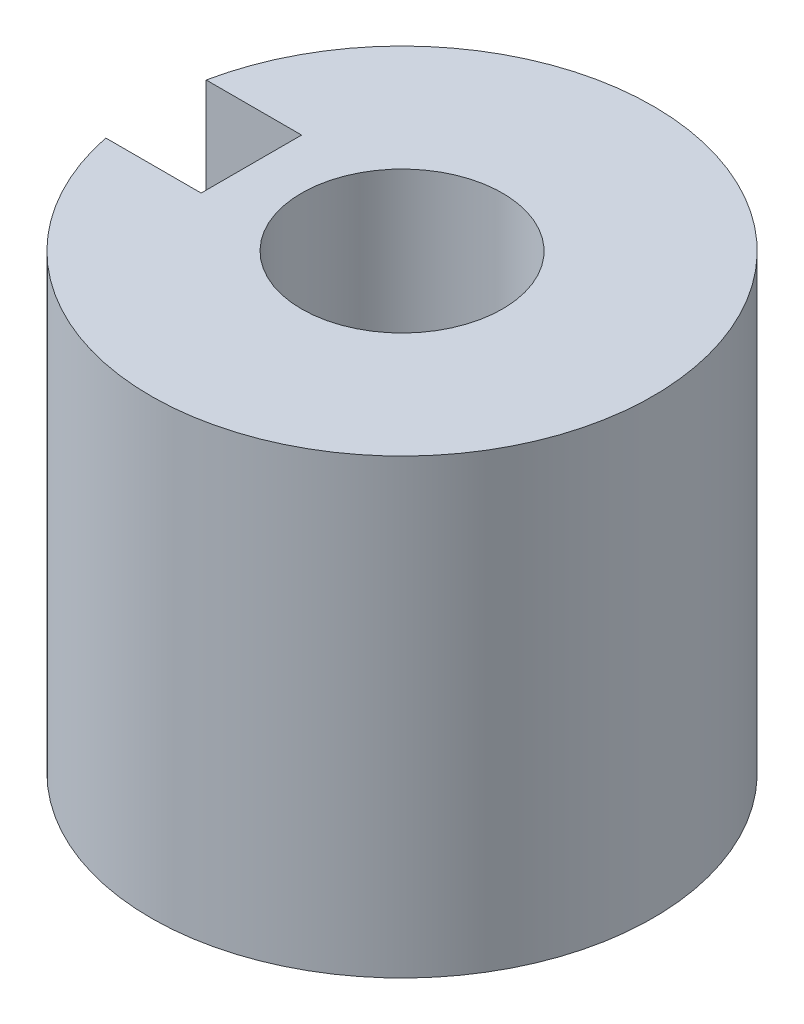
ISO-10303-21;
HEADER;
FILE_DESCRIPTION(('STEP AP214'),'2;1');
FILE_NAME('part.step','',(''),(''),'','','');
FILE_SCHEMA(('AUTOMOTIVE_DESIGN { 1 0 10303 214 1 1 1 1 }'));
ENDSEC;
DATA;
#1=APPLICATION_CONTEXT('core data for automotive mechanical design processes');
#2=APPLICATION_PROTOCOL_DEFINITION('international standard','automotive_design',2000,#1);
#3=PRODUCT_CONTEXT('',#1,'mechanical');
#4=PRODUCT('Part','Part','',(#3));
#5=PRODUCT_RELATED_PRODUCT_CATEGORY('part','',(#4));
#6=PRODUCT_DEFINITION_FORMATION('','',#4);
#7=PRODUCT_DEFINITION_CONTEXT('part definition',#1,'design');
#8=PRODUCT_DEFINITION('design','',#6,#7);
#9=PRODUCT_DEFINITION_SHAPE('','',#8);
#10=(LENGTH_UNIT() NAMED_UNIT(*) SI_UNIT(.MILLI.,.METRE.));
#11=(NAMED_UNIT(*) PLANE_ANGLE_UNIT() SI_UNIT($,.RADIAN.));
#12=(NAMED_UNIT(*) SI_UNIT($,.STERADIAN.) SOLID_ANGLE_UNIT());
#13=UNCERTAINTY_MEASURE_WITH_UNIT(LENGTH_MEASURE(1.E-05),#10,'distance_accuracy_value','');
#14=(GEOMETRIC_REPRESENTATION_CONTEXT(3) GLOBAL_UNCERTAINTY_ASSIGNED_CONTEXT((#13)) GLOBAL_UNIT_ASSIGNED_CONTEXT((#10,
#11,#12)) REPRESENTATION_CONTEXT('',''));
#15=CARTESIAN_POINT('',(0.,0.,0.));
#16=DIRECTION('',(0.,0.,1.));
#17=DIRECTION('',(1.,0.,0.));
#18=AXIS2_PLACEMENT_3D('',#15,#16,#17);
#19=CARTESIAN_POINT('',(2.5,4.5,0.));
#20=DIRECTION('',(0.,-1.,0.));
#21=DIRECTION('',(0.,0.,-1.));
#22=AXIS2_PLACEMENT_3D('',#19,#20,#21);
#23=CYLINDRICAL_SURFACE('',#22,2.5);
#24=DIRECTION('',(0.,-1.,0.));
#25=VECTOR('',#24,1.);
#26=CARTESIAN_POINT('',(0.0505102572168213,4.5,0.5));
#27=LINE('',#26,#25);
#28=CARTESIAN_POINT('',(0.0505102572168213,0.,0.5));
#29=VERTEX_POINT('',#28);
#30=CARTESIAN_POINT('',(0.0505102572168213,1.5,0.5));
#31=VERTEX_POINT('',#30);
#32=EDGE_CURVE('E39',#29,#31,#27,.F.);
#33=ORIENTED_EDGE('',*,*,#32,.F.);
#34=CARTESIAN_POINT('',(2.5,0.,0.));
#35=DIRECTION('',(0.,1.,0.));
#36=DIRECTION('',(0.,0.,1.));
#37=AXIS2_PLACEMENT_3D('',#34,#35,#36);
#38=CIRCLE('',#37,2.5);
#39=CARTESIAN_POINT('',(0.0505102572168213,0.,-0.5));
#40=VERTEX_POINT('',#39);
#41=EDGE_CURVE('E148',#29,#40,#38,.T.);
#42=ORIENTED_EDGE('',*,*,#41,.T.);
#43=DIRECTION('',(0.,-1.,0.));
#44=VECTOR('',#43,1.);
#45=CARTESIAN_POINT('',(0.0505102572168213,4.5,-0.5));
#46=LINE('',#45,#44);
#47=CARTESIAN_POINT('',(0.0505102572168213,1.5,-0.5));
#48=VERTEX_POINT('',#47);
#49=EDGE_CURVE('E158',#48,#40,#46,.T.);
#50=ORIENTED_EDGE('',*,*,#49,.F.);
#51=CARTESIAN_POINT('',(2.5,1.5,0.));
#52=DIRECTION('',(0.,-1.,0.));
#53=DIRECTION('',(0.,0.,-1.));
#54=AXIS2_PLACEMENT_3D('',#51,#52,#53);
#55=CIRCLE('',#54,2.5);
#56=EDGE_CURVE('E154',#31,#48,#55,.T.);
#57=ORIENTED_EDGE('',*,*,#56,.F.);
#58=EDGE_LOOP('',(#33,#42,#50,#57));
#59=FACE_BOUND('',#58,.T.);
#60=CARTESIAN_POINT('',(2.5,3.,0.));
#61=DIRECTION('',(0.,1.,0.));
#62=DIRECTION('',(0.,0.,1.));
#63=AXIS2_PLACEMENT_3D('',#60,#61,#62);
#64=CIRCLE('',#63,2.5);
#65=CARTESIAN_POINT('',(0.0505102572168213,3.,-0.5));
#66=VERTEX_POINT('',#65);
#67=CARTESIAN_POINT('',(0.0505102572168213,3.,0.5));
#68=VERTEX_POINT('',#67);
#69=EDGE_CURVE('E11',#66,#68,#64,.T.);
#70=ORIENTED_EDGE('',*,*,#69,.F.);
#71=DIRECTION('',(0.,-1.,0.));
#72=VECTOR('',#71,1.);
#73=CARTESIAN_POINT('',(0.0505102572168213,4.5,-0.5));
#74=LINE('',#73,#72);
#75=CARTESIAN_POINT('',(0.0505102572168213,4.5,-0.5));
#76=VERTEX_POINT('',#75);
#77=EDGE_CURVE('E114',#76,#66,#74,.T.);
#78=ORIENTED_EDGE('',*,*,#77,.F.);
#79=CARTESIAN_POINT('',(2.5,4.5,0.));
#80=DIRECTION('',(0.,1.,0.));
#81=DIRECTION('',(0.,0.,1.));
#82=AXIS2_PLACEMENT_3D('',#79,#80,#81);
#83=CIRCLE('',#82,2.5);
#84=CARTESIAN_POINT('',(0.0505102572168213,4.5,0.5));
#85=VERTEX_POINT('',#84);
#86=EDGE_CURVE('E151',#85,#76,#83,.T.);
#87=ORIENTED_EDGE('',*,*,#86,.F.);
#88=DIRECTION('',(0.,-1.,0.));
#89=VECTOR('',#88,1.);
#90=CARTESIAN_POINT('',(0.0505102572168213,4.5,0.5));
#91=LINE('',#90,#89);
#92=EDGE_CURVE('E118',#68,#85,#91,.F.);
#93=ORIENTED_EDGE('',*,*,#92,.F.);
#94=EDGE_LOOP('',(#70,#78,#87,#93));
#95=FACE_BOUND('',#94,.T.);
#96=ADVANCED_FACE('F32',(#59,#95),#23,.T.);
#97=CARTESIAN_POINT('',(2.5,4.5,0.));
#98=DIRECTION('',(0.,1.,0.));
#99=DIRECTION('',(0.,0.,1.));
#100=AXIS2_PLACEMENT_3D('',#97,#98,#99);
#101=PLANE('',#100);
#102=CARTESIAN_POINT('',(2.5,4.5,0.));
#103=DIRECTION('',(0.,1.,0.));
#104=DIRECTION('',(0.,0.,1.));
#105=AXIS2_PLACEMENT_3D('',#102,#103,#104);
#106=CIRCLE('',#105,1.);
#107=CARTESIAN_POINT('',(2.5,4.5,1.));
#108=VERTEX_POINT('',#107);
#109=EDGE_CURVE('E145',#108,#108,#106,.T.);
#110=ORIENTED_EDGE('',*,*,#109,.F.);
#111=EDGE_LOOP('',(#110));
#112=FACE_BOUND('',#111,.T.);
#113=DIRECTION('',(0.,0.,1.));
#114=VECTOR('',#113,1.);
#115=CARTESIAN_POINT('',(1.,4.5,-0.5));
#116=LINE('',#115,#114);
#117=CARTESIAN_POINT('',(1.,4.5,-0.5));
#118=VERTEX_POINT('',#117);
#119=CARTESIAN_POINT('',(1.,4.5,0.5));
#120=VERTEX_POINT('',#119);
#121=EDGE_CURVE('E274',#118,#120,#116,.T.);
#122=ORIENTED_EDGE('',*,*,#121,.T.);
#123=DIRECTION('',(-1.,0.,0.));
#124=VECTOR('',#123,1.);
#125=CARTESIAN_POINT('',(1.,4.5,0.5));
#126=LINE('',#125,#124);
#127=EDGE_CURVE('E110',#120,#85,#126,.T.);
#128=ORIENTED_EDGE('',*,*,#127,.T.);
#129=ORIENTED_EDGE('',*,*,#86,.T.);
#130=DIRECTION('',(-1.,0.,0.));
#131=VECTOR('',#130,1.);
#132=CARTESIAN_POINT('',(1.,4.5,-0.5));
#133=LINE('',#132,#131);
#134=EDGE_CURVE('E120',#118,#76,#133,.T.);
#135=ORIENTED_EDGE('',*,*,#134,.F.);
#136=EDGE_LOOP('',(#122,#128,#129,#135));
#137=FACE_BOUND('',#136,.T.);
#138=ADVANCED_FACE('F187',(#112,#137),#101,.T.);
#139=CARTESIAN_POINT('',(2.5,0.,0.));
#140=DIRECTION('',(0.,1.,0.));
#141=DIRECTION('',(0.,0.,1.));
#142=AXIS2_PLACEMENT_3D('',#139,#140,#141);
#143=PLANE('',#142);
#144=CARTESIAN_POINT('',(2.5,0.,0.));
#145=DIRECTION('',(0.,1.,0.));
#146=DIRECTION('',(0.,0.,1.));
#147=AXIS2_PLACEMENT_3D('',#144,#145,#146);
#148=CIRCLE('',#147,1.);
#149=CARTESIAN_POINT('',(2.5,0.,1.));
#150=VERTEX_POINT('',#149);
#151=EDGE_CURVE('E144',#150,#150,#148,.T.);
#152=ORIENTED_EDGE('',*,*,#151,.T.);
#153=EDGE_LOOP('',(#152));
#154=FACE_BOUND('',#153,.T.);
#155=DIRECTION('',(-1.,0.,0.));
#156=VECTOR('',#155,1.);
#157=CARTESIAN_POINT('',(1.,0.,0.5));
#158=LINE('',#157,#156);
#159=CARTESIAN_POINT('',(1.,0.,0.5));
#160=VERTEX_POINT('',#159);
#161=EDGE_CURVE('E54',#160,#29,#158,.T.);
#162=ORIENTED_EDGE('',*,*,#161,.F.);
#163=DIRECTION('',(0.,0.,-1.));
#164=VECTOR('',#163,1.);
#165=CARTESIAN_POINT('',(1.,0.,-0.5));
#166=LINE('',#165,#164);
#167=CARTESIAN_POINT('',(1.,0.,-0.5));
#168=VERTEX_POINT('',#167);
#169=EDGE_CURVE('E127',#160,#168,#166,.T.);
#170=ORIENTED_EDGE('',*,*,#169,.T.);
#171=DIRECTION('',(-1.,0.,0.));
#172=VECTOR('',#171,1.);
#173=CARTESIAN_POINT('',(1.,0.,-0.5));
#174=LINE('',#173,#172);
#175=EDGE_CURVE('E140',#168,#40,#174,.T.);
#176=ORIENTED_EDGE('',*,*,#175,.T.);
#177=ORIENTED_EDGE('',*,*,#41,.F.);
#178=EDGE_LOOP('',(#162,#170,#176,#177));
#179=FACE_BOUND('',#178,.T.);
#180=ADVANCED_FACE('F172',(#154,#179),#143,.F.);
#181=CARTESIAN_POINT('',(2.5,4.5,0.));
#182=DIRECTION('',(0.,-1.,0.));
#183=DIRECTION('',(0.,0.,-1.));
#184=AXIS2_PLACEMENT_3D('',#181,#182,#183);
#185=CYLINDRICAL_SURFACE('',#184,1.);
#186=ORIENTED_EDGE('',*,*,#109,.T.);
#187=EDGE_LOOP('',(#186));
#188=FACE_BOUND('',#187,.T.);
#189=ORIENTED_EDGE('',*,*,#151,.F.);
#190=EDGE_LOOP('',(#189));
#191=FACE_BOUND('',#190,.T.);
#192=ADVANCED_FACE('F184',(#188,#191),#185,.F.);
#193=CARTESIAN_POINT('',(1.,0.,0.5));
#194=DIRECTION('',(0.,0.,-1.));
#195=DIRECTION('',(0.,1.,0.));
#196=AXIS2_PLACEMENT_3D('',#193,#194,#195);
#197=PLANE('',#196);
#198=ORIENTED_EDGE('',*,*,#32,.T.);
#199=DIRECTION('',(-1.,0.,0.));
#200=VECTOR('',#199,1.);
#201=CARTESIAN_POINT('',(1.,1.5,0.5));
#202=LINE('',#201,#200);
#203=CARTESIAN_POINT('',(1.,1.5,0.5));
#204=VERTEX_POINT('',#203);
#205=EDGE_CURVE('E134',#204,#31,#202,.T.);
#206=ORIENTED_EDGE('',*,*,#205,.F.);
#207=DIRECTION('',(0.,-1.,0.));
#208=VECTOR('',#207,1.);
#209=CARTESIAN_POINT('',(1.,0.,0.5));
#210=LINE('',#209,#208);
#211=EDGE_CURVE('E125',#204,#160,#210,.T.);
#212=ORIENTED_EDGE('',*,*,#211,.T.);
#213=ORIENTED_EDGE('',*,*,#161,.T.);
#214=EDGE_LOOP('',(#198,#206,#212,#213));
#215=FACE_BOUND('',#214,.T.);
#216=ADVANCED_FACE('F160',(#215),#197,.T.);
#217=CARTESIAN_POINT('',(1.,0.,-0.5));
#218=DIRECTION('',(0.,0.,1.));
#219=DIRECTION('',(0.,-1.,0.));
#220=AXIS2_PLACEMENT_3D('',#217,#218,#219);
#221=PLANE('',#220);
#222=ORIENTED_EDGE('',*,*,#49,.T.);
#223=ORIENTED_EDGE('',*,*,#175,.F.);
#224=DIRECTION('',(0.,1.,0.));
#225=VECTOR('',#224,1.);
#226=CARTESIAN_POINT('',(1.,0.,-0.5));
#227=LINE('',#226,#225);
#228=CARTESIAN_POINT('',(1.,1.5,-0.5));
#229=VERTEX_POINT('',#228);
#230=EDGE_CURVE('E130',#168,#229,#227,.T.);
#231=ORIENTED_EDGE('',*,*,#230,.T.);
#232=DIRECTION('',(-1.,0.,0.));
#233=VECTOR('',#232,1.);
#234=CARTESIAN_POINT('',(1.,1.5,-0.5));
#235=LINE('',#234,#233);
#236=EDGE_CURVE('E137',#229,#48,#235,.T.);
#237=ORIENTED_EDGE('',*,*,#236,.T.);
#238=EDGE_LOOP('',(#222,#223,#231,#237));
#239=FACE_BOUND('',#238,.T.);
#240=ADVANCED_FACE('F176',(#239),#221,.T.);
#241=CARTESIAN_POINT('',(1.,1.5,-0.5));
#242=DIRECTION('',(0.,-1.,0.));
#243=DIRECTION('',(0.,0.,-1.));
#244=AXIS2_PLACEMENT_3D('',#241,#242,#243);
#245=PLANE('',#244);
#246=ORIENTED_EDGE('',*,*,#205,.T.);
#247=ORIENTED_EDGE('',*,*,#56,.T.);
#248=ORIENTED_EDGE('',*,*,#236,.F.);
#249=DIRECTION('',(0.,0.,1.));
#250=VECTOR('',#249,1.);
#251=CARTESIAN_POINT('',(1.,1.5,-0.5));
#252=LINE('',#251,#250);
#253=EDGE_CURVE('E132',#229,#204,#252,.T.);
#254=ORIENTED_EDGE('',*,*,#253,.T.);
#255=EDGE_LOOP('',(#246,#247,#248,#254));
#256=FACE_BOUND('',#255,.T.);
#257=ADVANCED_FACE('F165',(#256),#245,.T.);
#258=CARTESIAN_POINT('',(1.,0.,0.));
#259=DIRECTION('',(1.,0.,0.));
#260=DIRECTION('',(0.,0.,-1.));
#261=AXIS2_PLACEMENT_3D('',#258,#259,#260);
#262=PLANE('',#261);
#263=ORIENTED_EDGE('',*,*,#211,.F.);
#264=ORIENTED_EDGE('',*,*,#253,.F.);
#265=ORIENTED_EDGE('',*,*,#230,.F.);
#266=ORIENTED_EDGE('',*,*,#169,.F.);
#267=EDGE_LOOP('',(#263,#264,#265,#266));
#268=FACE_BOUND('',#267,.T.);
#269=ADVANCED_FACE('F170',(#268),#262,.F.);
#270=CARTESIAN_POINT('',(1.,3.,-0.5));
#271=DIRECTION('',(0.,1.,0.));
#272=DIRECTION('',(0.,0.,1.));
#273=AXIS2_PLACEMENT_3D('',#270,#271,#272);
#274=PLANE('',#273);
#275=DIRECTION('',(-1.,0.,0.));
#276=VECTOR('',#275,1.);
#277=CARTESIAN_POINT('',(1.,3.,-0.5));
#278=LINE('',#277,#276);
#279=CARTESIAN_POINT('',(1.,3.,-0.5));
#280=VERTEX_POINT('',#279);
#281=EDGE_CURVE('E115',#280,#66,#278,.T.);
#282=ORIENTED_EDGE('',*,*,#281,.T.);
#283=ORIENTED_EDGE('',*,*,#69,.T.);
#284=DIRECTION('',(-1.,0.,0.));
#285=VECTOR('',#284,1.);
#286=CARTESIAN_POINT('',(1.,3.,0.5));
#287=LINE('',#286,#285);
#288=CARTESIAN_POINT('',(1.,3.,0.5));
#289=VERTEX_POINT('',#288);
#290=EDGE_CURVE('E107',#289,#68,#287,.T.);
#291=ORIENTED_EDGE('',*,*,#290,.F.);
#292=DIRECTION('',(0.,0.,-1.));
#293=VECTOR('',#292,1.);
#294=CARTESIAN_POINT('',(1.,3.,-0.5));
#295=LINE('',#294,#293);
#296=EDGE_CURVE('E96',#289,#280,#295,.T.);
#297=ORIENTED_EDGE('',*,*,#296,.T.);
#298=EDGE_LOOP('',(#282,#283,#291,#297));
#299=FACE_BOUND('',#298,.T.);
#300=ADVANCED_FACE('F113',(#299),#274,.T.);
#301=CARTESIAN_POINT('',(1.,3.,0.5));
#302=DIRECTION('',(0.,0.,-1.));
#303=DIRECTION('',(0.,1.,0.));
#304=AXIS2_PLACEMENT_3D('',#301,#302,#303);
#305=PLANE('',#304);
#306=ORIENTED_EDGE('',*,*,#92,.T.);
#307=ORIENTED_EDGE('',*,*,#127,.F.);
#308=DIRECTION('',(0.,-1.,0.));
#309=VECTOR('',#308,1.);
#310=CARTESIAN_POINT('',(1.,3.,0.5));
#311=LINE('',#310,#309);
#312=EDGE_CURVE('E46',#120,#289,#311,.T.);
#313=ORIENTED_EDGE('',*,*,#312,.T.);
#314=ORIENTED_EDGE('',*,*,#290,.T.);
#315=EDGE_LOOP('',(#306,#307,#313,#314));
#316=FACE_BOUND('',#315,.T.);
#317=ADVANCED_FACE('F106',(#316),#305,.T.);
#318=CARTESIAN_POINT('',(1.,3.,-0.5));
#319=DIRECTION('',(0.,0.,1.));
#320=DIRECTION('',(1.,0.,0.));
#321=AXIS2_PLACEMENT_3D('',#318,#319,#320);
#322=PLANE('',#321);
#323=ORIENTED_EDGE('',*,*,#77,.T.);
#324=ORIENTED_EDGE('',*,*,#281,.F.);
#325=DIRECTION('',(0.,1.,0.));
#326=VECTOR('',#325,1.);
#327=CARTESIAN_POINT('',(1.,3.,-0.5));
#328=LINE('',#327,#326);
#329=EDGE_CURVE('E98',#280,#118,#328,.T.);
#330=ORIENTED_EDGE('',*,*,#329,.T.);
#331=ORIENTED_EDGE('',*,*,#134,.T.);
#332=EDGE_LOOP('',(#323,#324,#330,#331));
#333=FACE_BOUND('',#332,.T.);
#334=ADVANCED_FACE('F250',(#333),#322,.T.);
#335=CARTESIAN_POINT('',(1.,0.,0.));
#336=DIRECTION('',(1.,0.,0.));
#337=DIRECTION('',(0.,0.,-1.));
#338=AXIS2_PLACEMENT_3D('',#335,#336,#337);
#339=PLANE('',#338);
#340=ORIENTED_EDGE('',*,*,#312,.F.);
#341=ORIENTED_EDGE('',*,*,#121,.F.);
#342=ORIENTED_EDGE('',*,*,#329,.F.);
#343=ORIENTED_EDGE('',*,*,#296,.F.);
#344=EDGE_LOOP('',(#340,#341,#342,#343));
#345=FACE_BOUND('',#344,.T.);
#346=ADVANCED_FACE('F97',(#345),#339,.F.);
#347=CLOSED_SHELL('',(#96,#138,#180,#192,#216,#240,#257,#269,#300,#317,#334,#346));
#348=MANIFOLD_SOLID_BREP('B2',#347);
#349=ADVANCED_BREP_SHAPE_REPRESENTATION('',(#18,#348),#14);
#350=SHAPE_DEFINITION_REPRESENTATION(#9,#349);
ENDSEC;
END-ISO-10303-21;
